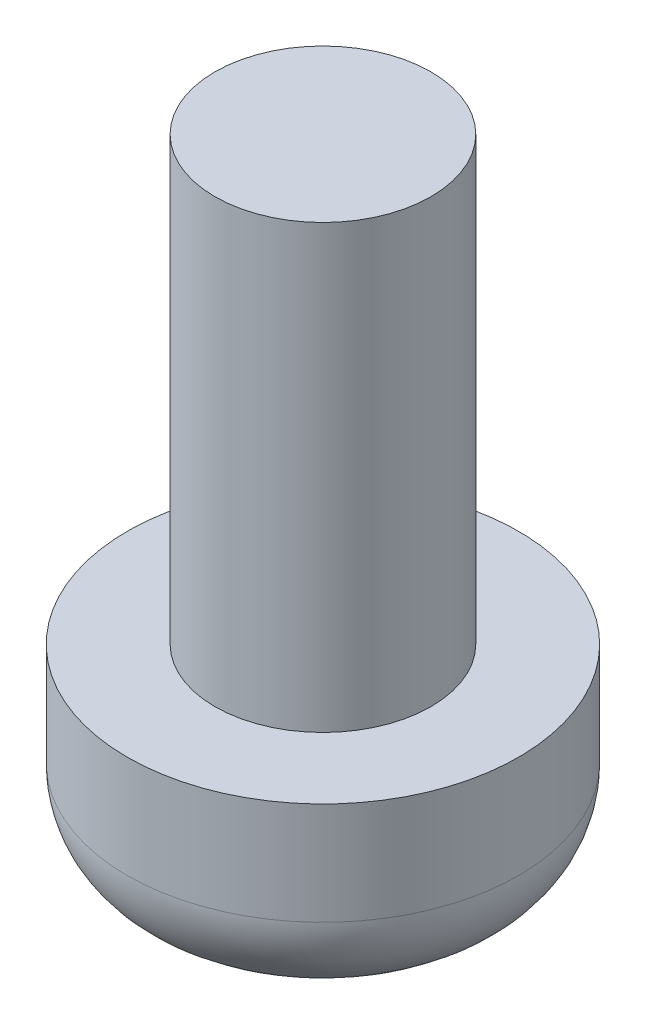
from build123d import *

# Parameters (mm, degrees)
SKETCH_HEX_R        = 2.667
BOSS_EXTRUDE1_DEPTH = 2.667
SKETCH3_R           = 1.4732
BOSS_EXTRUDE2_DEPTH = 6.0198
FILLET1_R           = 1.27


with BuildPart() as part:
    # Sketch-Hex → Boss-Extrude1 (new body)
    with BuildSketch(Plane(origin=(0, 0, 0), x_dir=(1, 0, 0), z_dir=(0, 1, 0))):
        with Locations(Location((0, 0, 0), (0, 0, 270))):
            Circle(SKETCH_HEX_R)
    extrude(amount=BOSS_EXTRUDE1_DEPTH)

    # Sketch3 → Boss-Extrude2 (add)
    with BuildSketch(Plane(origin=(0, 2.667, 0), x_dir=(1, 0, 0), z_dir=(0, 1, 0))):
        with Locations(Location((0, 0, 0), (0, 0, 270))):
            Circle(SKETCH3_R)
    extrude(amount=BOSS_EXTRUDE2_DEPTH)

    # Fillet1
    fillet1_edges = [part.edges().sort_by_distance(p)[0] for p in [
        (0, 0, -2.667),
    ]]
    fillet(fillet1_edges, radius=FILLET1_R)


solid = part.part
